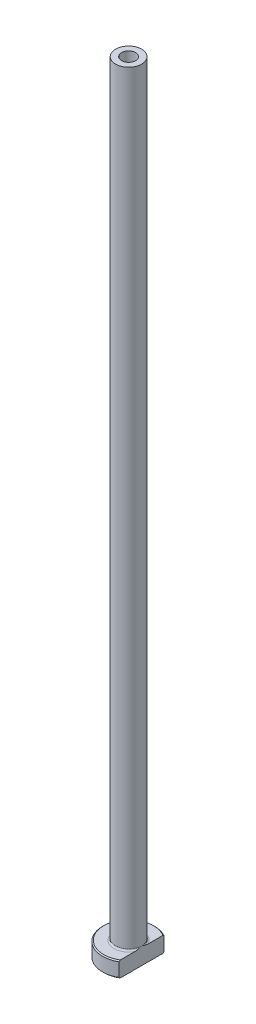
ISO-10303-21;
HEADER;
FILE_DESCRIPTION(('STEP AP214'),'2;1');
FILE_NAME('part.step','',(''),(''),'','','');
FILE_SCHEMA(('AUTOMOTIVE_DESIGN { 1 0 10303 214 1 1 1 1 }'));
ENDSEC;
DATA;
#1=APPLICATION_CONTEXT('core data for automotive mechanical design processes');
#2=APPLICATION_PROTOCOL_DEFINITION('international standard','automotive_design',2000,#1);
#3=PRODUCT_CONTEXT('',#1,'mechanical');
#4=PRODUCT('Part','Part','',(#3));
#5=PRODUCT_RELATED_PRODUCT_CATEGORY('part','',(#4));
#6=PRODUCT_DEFINITION_FORMATION('','',#4);
#7=PRODUCT_DEFINITION_CONTEXT('part definition',#1,'design');
#8=PRODUCT_DEFINITION('design','',#6,#7);
#9=PRODUCT_DEFINITION_SHAPE('','',#8);
#10=(LENGTH_UNIT() NAMED_UNIT(*) SI_UNIT(.MILLI.,.METRE.));
#11=(NAMED_UNIT(*) PLANE_ANGLE_UNIT() SI_UNIT($,.RADIAN.));
#12=(NAMED_UNIT(*) SI_UNIT($,.STERADIAN.) SOLID_ANGLE_UNIT());
#13=UNCERTAINTY_MEASURE_WITH_UNIT(LENGTH_MEASURE(1.E-05),#10,'distance_accuracy_value','');
#14=(GEOMETRIC_REPRESENTATION_CONTEXT(3) GLOBAL_UNCERTAINTY_ASSIGNED_CONTEXT((#13)) GLOBAL_UNIT_ASSIGNED_CONTEXT((#10,
#11,#12)) REPRESENTATION_CONTEXT('',''));
#15=CARTESIAN_POINT('',(0.,0.,0.));
#16=DIRECTION('',(0.,0.,1.));
#17=DIRECTION('',(1.,0.,0.));
#18=AXIS2_PLACEMENT_3D('',#15,#16,#17);
#19=CARTESIAN_POINT('',(0.,92.1876809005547,0.));
#20=DIRECTION('',(0.,1.,0.));
#21=DIRECTION('',(0.,0.,1.));
#22=AXIS2_PLACEMENT_3D('',#19,#20,#21);
#23=CYLINDRICAL_SURFACE('',#22,1.35);
#24=CARTESIAN_POINT('',(0.,150.,0.));
#25=DIRECTION('',(0.,1.,0.));
#26=DIRECTION('',(0.,0.,1.));
#27=AXIS2_PLACEMENT_3D('',#24,#25,#26);
#28=CIRCLE('',#27,1.35);
#29=CARTESIAN_POINT('',(0.,150.,1.35));
#30=VERTEX_POINT('',#29);
#31=EDGE_CURVE('E167',#30,#30,#28,.T.);
#32=ORIENTED_EDGE('',*,*,#31,.T.);
#33=EDGE_LOOP('',(#32));
#34=FACE_BOUND('',#33,.T.);
#35=CARTESIAN_POINT('',(0.,105.,0.));
#36=DIRECTION('',(0.,1.,0.));
#37=DIRECTION('',(0.,0.,1.));
#38=AXIS2_PLACEMENT_3D('',#35,#36,#37);
#39=CIRCLE('',#38,1.35);
#40=CARTESIAN_POINT('',(0.,105.,1.35));
#41=VERTEX_POINT('',#40);
#42=EDGE_CURVE('E170',#41,#41,#39,.T.);
#43=ORIENTED_EDGE('',*,*,#42,.F.);
#44=EDGE_LOOP('',(#43));
#45=FACE_BOUND('',#44,.T.);
#46=ADVANCED_FACE('F32',(#34,#45),#23,.F.);
#47=CARTESIAN_POINT('',(-1.35,150.,0.));
#48=DIRECTION('',(0.,1.,0.));
#49=DIRECTION('',(0.,0.,1.));
#50=AXIS2_PLACEMENT_3D('',#47,#48,#49);
#51=PLANE('',#50);
#52=CARTESIAN_POINT('',(0.,150.,0.));
#53=DIRECTION('',(0.,1.,0.));
#54=DIRECTION('',(0.,0.,1.));
#55=AXIS2_PLACEMENT_3D('',#52,#53,#54);
#56=CIRCLE('',#55,2.50000000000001);
#57=CARTESIAN_POINT('',(0.,150.,2.50000000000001));
#58=VERTEX_POINT('',#57);
#59=EDGE_CURVE('E174',#58,#58,#56,.T.);
#60=ORIENTED_EDGE('',*,*,#59,.T.);
#61=EDGE_LOOP('',(#60));
#62=FACE_BOUND('',#61,.T.);
#63=ORIENTED_EDGE('',*,*,#31,.F.);
#64=EDGE_LOOP('',(#63));
#65=FACE_BOUND('',#64,.T.);
#66=ADVANCED_FACE('F157',(#62,#65),#51,.T.);
#67=CARTESIAN_POINT('',(0.,92.1876809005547,0.));
#68=DIRECTION('',(0.,1.,0.));
#69=DIRECTION('',(0.,0.,1.));
#70=AXIS2_PLACEMENT_3D('',#67,#68,#69);
#71=CYLINDRICAL_SURFACE('',#70,2.5);
#72=CARTESIAN_POINT('',(0.,3.3,0.));
#73=DIRECTION('',(0.,1.,0.));
#74=DIRECTION('',(0.,0.,1.));
#75=AXIS2_PLACEMENT_3D('',#72,#73,#74);
#76=CIRCLE('',#75,2.5);
#77=CARTESIAN_POINT('',(2.5,3.3,0.));
#78=VERTEX_POINT('',#77);
#79=EDGE_CURVE('E180',#78,#78,#76,.T.);
#80=ORIENTED_EDGE('',*,*,#79,.T.);
#81=EDGE_LOOP('',(#80));
#82=FACE_BOUND('',#81,.T.);
#83=ORIENTED_EDGE('',*,*,#59,.F.);
#84=EDGE_LOOP('',(#83));
#85=FACE_BOUND('',#84,.T.);
#86=ADVANCED_FACE('F162',(#82,#85),#71,.T.);
#87=CARTESIAN_POINT('',(-2.49999999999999,3.,0.));
#88=DIRECTION('',(0.,1.,0.));
#89=DIRECTION('',(0.,0.,1.));
#90=AXIS2_PLACEMENT_3D('',#87,#88,#89);
#91=PLANE('',#90);
#92=DIRECTION('',(0.,0.,1.));
#93=VECTOR('',#92,1.);
#94=CARTESIAN_POINT('',(2.49999999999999,3.,0.));
#95=LINE('',#94,#93);
#96=CARTESIAN_POINT('',(2.5,3.,-4.09756024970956));
#97=VERTEX_POINT('',#96);
#98=CARTESIAN_POINT('',(2.49999999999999,3.,-1.26095202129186));
#99=VERTEX_POINT('',#98);
#100=EDGE_CURVE('E54',#97,#99,#95,.T.);
#101=ORIENTED_EDGE('',*,*,#100,.F.);
#102=CARTESIAN_POINT('',(0.,3.,0.));
#103=DIRECTION('',(0.,1.,0.));
#104=DIRECTION('',(0.,0.,1.));
#105=AXIS2_PLACEMENT_3D('',#102,#103,#104);
#106=CIRCLE('',#105,4.79999999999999);
#107=CARTESIAN_POINT('',(2.49999999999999,3.,4.09756024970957));
#108=VERTEX_POINT('',#107);
#109=EDGE_CURVE('E186',#97,#108,#106,.T.);
#110=ORIENTED_EDGE('',*,*,#109,.T.);
#111=CARTESIAN_POINT('',(2.49999999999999,3.,1.26095202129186));
#112=VERTEX_POINT('',#111);
#113=EDGE_CURVE('E134',#112,#108,#95,.T.);
#114=ORIENTED_EDGE('',*,*,#113,.F.);
#115=CARTESIAN_POINT('',(0.,3.,0.));
#116=DIRECTION('',(0.,1.,0.));
#117=DIRECTION('',(0.,0.,1.));
#118=AXIS2_PLACEMENT_3D('',#115,#116,#117);
#119=CIRCLE('',#118,2.8);
#120=EDGE_CURVE('E183',#112,#99,#119,.F.);
#121=ORIENTED_EDGE('',*,*,#120,.T.);
#122=EDGE_LOOP('',(#101,#110,#114,#121));
#123=FACE_BOUND('',#122,.T.);
#124=ADVANCED_FACE('F197',(#123),#91,.T.);
#125=CARTESIAN_POINT('',(0.,92.1876809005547,0.));
#126=DIRECTION('',(0.,1.,0.));
#127=DIRECTION('',(0.,0.,1.));
#128=AXIS2_PLACEMENT_3D('',#125,#126,#127);
#129=CYLINDRICAL_SURFACE('',#128,4.99999999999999);
#130=DIRECTION('',(0.,-1.,0.));
#131=VECTOR('',#130,1.);
#132=CARTESIAN_POINT('',(2.49999999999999,150.,4.33012701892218));
#133=LINE('',#132,#131);
#134=CARTESIAN_POINT('',(2.49999999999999,2.8,4.33012701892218));
#135=VERTEX_POINT('',#134);
#136=CARTESIAN_POINT('',(2.49999999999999,0.199999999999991,4.33012701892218));
#137=VERTEX_POINT('',#136);
#138=EDGE_CURVE('E82',#135,#137,#133,.T.);
#139=ORIENTED_EDGE('',*,*,#138,.F.);
#140=CARTESIAN_POINT('',(0.,2.8,0.));
#141=DIRECTION('',(0.,1.,0.));
#142=DIRECTION('',(0.,0.,1.));
#143=AXIS2_PLACEMENT_3D('',#140,#141,#142);
#144=CIRCLE('',#143,4.99999999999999);
#145=CARTESIAN_POINT('',(2.5,2.8,-4.33012701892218));
#146=VERTEX_POINT('',#145);
#147=EDGE_CURVE('E95',#135,#146,#144,.F.);
#148=ORIENTED_EDGE('',*,*,#147,.T.);
#149=DIRECTION('',(0.,-1.,0.));
#150=VECTOR('',#149,1.);
#151=CARTESIAN_POINT('',(2.5,150.,-4.33012701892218));
#152=LINE('',#151,#150);
#153=CARTESIAN_POINT('',(2.5,0.199999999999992,-4.33012701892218));
#154=VERTEX_POINT('',#153);
#155=EDGE_CURVE('E192',#146,#154,#152,.T.);
#156=ORIENTED_EDGE('',*,*,#155,.T.);
#157=CARTESIAN_POINT('',(0.,0.199999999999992,0.));
#158=DIRECTION('',(0.,-1.,0.));
#159=DIRECTION('',(0.,0.,-1.));
#160=AXIS2_PLACEMENT_3D('',#157,#158,#159);
#161=CIRCLE('',#160,4.99999999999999);
#162=EDGE_CURVE('E98',#154,#137,#161,.F.);
#163=ORIENTED_EDGE('',*,*,#162,.T.);
#164=EDGE_LOOP('',(#139,#148,#156,#163));
#165=FACE_BOUND('',#164,.T.);
#166=ADVANCED_FACE('F190',(#165),#129,.T.);
#167=CARTESIAN_POINT('',(-4.99999999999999,0.,0.));
#168=DIRECTION('',(0.,-1.,0.));
#169=DIRECTION('',(0.,0.,-1.));
#170=AXIS2_PLACEMENT_3D('',#167,#168,#169);
#171=PLANE('',#170);
#172=CARTESIAN_POINT('',(0.,0.,0.));
#173=DIRECTION('',(0.,-1.,0.));
#174=DIRECTION('',(0.,0.,-1.));
#175=AXIS2_PLACEMENT_3D('',#172,#173,#174);
#176=CIRCLE('',#175,2.09999999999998);
#177=CARTESIAN_POINT('',(0.,0.,-2.09999999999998));
#178=VERTEX_POINT('',#177);
#179=EDGE_CURVE('E40',#178,#178,#176,.F.);
#180=ORIENTED_EDGE('',*,*,#179,.T.);
#181=EDGE_LOOP('',(#180));
#182=FACE_BOUND('',#181,.T.);
#183=DIRECTION('',(0.,0.,-1.));
#184=VECTOR('',#183,1.);
#185=CARTESIAN_POINT('',(2.49999999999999,0.,4.33012701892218));
#186=LINE('',#185,#184);
#187=CARTESIAN_POINT('',(2.49999999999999,0.,4.09756024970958));
#188=VERTEX_POINT('',#187);
#189=CARTESIAN_POINT('',(2.5,0.,-4.09756024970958));
#190=VERTEX_POINT('',#189);
#191=EDGE_CURVE('E47',#188,#190,#186,.T.);
#192=ORIENTED_EDGE('',*,*,#191,.F.);
#193=CARTESIAN_POINT('',(0.,0.,0.));
#194=DIRECTION('',(0.,-1.,0.));
#195=DIRECTION('',(0.,0.,-1.));
#196=AXIS2_PLACEMENT_3D('',#193,#194,#195);
#197=CIRCLE('',#196,4.8);
#198=EDGE_CURVE('E92',#188,#190,#197,.T.);
#199=ORIENTED_EDGE('',*,*,#198,.T.);
#200=EDGE_LOOP('',(#192,#199));
#201=FACE_BOUND('',#200,.T.);
#202=ADVANCED_FACE('F91',(#182,#201),#171,.T.);
#203=CARTESIAN_POINT('',(0.,92.1876809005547,0.));
#204=DIRECTION('',(0.,1.,0.));
#205=DIRECTION('',(0.,0.,1.));
#206=AXIS2_PLACEMENT_3D('',#203,#204,#205);
#207=CYLINDRICAL_SURFACE('',#206,1.6);
#208=CARTESIAN_POINT('',(0.,0.499999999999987,0.));
#209=DIRECTION('',(0.,-1.,0.));
#210=DIRECTION('',(0.,0.,-1.));
#211=AXIS2_PLACEMENT_3D('',#208,#209,#210);
#212=CIRCLE('',#211,1.6);
#213=CARTESIAN_POINT('',(0.,0.499999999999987,-1.6));
#214=VERTEX_POINT('',#213);
#215=EDGE_CURVE('E11',#214,#214,#212,.T.);
#216=ORIENTED_EDGE('',*,*,#215,.T.);
#217=EDGE_LOOP('',(#216));
#218=FACE_BOUND('',#217,.T.);
#219=CARTESIAN_POINT('',(0.,93.,0.));
#220=DIRECTION('',(0.,1.,0.));
#221=DIRECTION('',(0.,0.,1.));
#222=AXIS2_PLACEMENT_3D('',#219,#220,#221);
#223=CIRCLE('',#222,1.6);
#224=CARTESIAN_POINT('',(0.,93.,1.6));
#225=VERTEX_POINT('',#224);
#226=EDGE_CURVE('E172',#225,#225,#223,.T.);
#227=ORIENTED_EDGE('',*,*,#226,.T.);
#228=EDGE_LOOP('',(#227));
#229=FACE_BOUND('',#228,.T.);
#230=ADVANCED_FACE('F215',(#218,#229),#207,.F.);
#231=CARTESIAN_POINT('',(0.,93.,0.));
#232=DIRECTION('',(0.,-1.,0.));
#233=DIRECTION('',(0.,0.,-1.));
#234=AXIS2_PLACEMENT_3D('',#231,#232,#233);
#235=CONICAL_SURFACE('',#234,1.6,0.0208303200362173);
#236=ORIENTED_EDGE('',*,*,#42,.T.);
#237=EDGE_LOOP('',(#236));
#238=FACE_BOUND('',#237,.T.);
#239=ORIENTED_EDGE('',*,*,#226,.F.);
#240=EDGE_LOOP('',(#239));
#241=FACE_BOUND('',#240,.T.);
#242=ADVANCED_FACE('F111',(#238,#241),#235,.F.);
#243=CARTESIAN_POINT('',(0.,3.3,0.));
#244=DIRECTION('',(0.,1.,0.));
#245=DIRECTION('',(0.,0.,1.));
#246=AXIS2_PLACEMENT_3D('',#243,#244,#245);
#247=TOROIDAL_SURFACE('',#246,2.8,0.3);
#248=ORIENTED_EDGE('',*,*,#120,.F.);
#249=CARTESIAN_POINT('',(2.5,3.3,0.));
#250=CARTESIAN_POINT('',(2.5,3.30000062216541,-4.84268862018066E-11));
#251=CARTESIAN_POINT('',(2.5,3.30000124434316,1.59621000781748E-07));
#252=CARTESIAN_POINT('',(2.5,3.30000243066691,6.45477837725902E-07));
#253=CARTESIAN_POINT('',(2.5,3.30000299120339,9.78480543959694E-07));
#254=CARTESIAN_POINT('',(2.5,3.30000411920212,1.77471958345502E-06));
#255=CARTESIAN_POINT('',(2.5,3.30000467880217,2.24902118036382E-06));
#256=CARTESIAN_POINT('',(2.5,3.30000572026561,3.2595365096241E-06));
#257=CARTESIAN_POINT('',(2.5,3.30000620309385,3.79480713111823E-06));
#258=CARTESIAN_POINT('',(2.5,3.30000787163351,5.75794592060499E-06));
#259=CARTESIAN_POINT('',(2.5,3.30000896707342,7.26424074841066E-06));
#260=CARTESIAN_POINT('',(2.5,3.3000108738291,1.03361126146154E-05));
#261=CARTESIAN_POINT('',(2.5,3.30001169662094,1.18949496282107E-05));
#262=CARTESIAN_POINT('',(2.5,3.30001489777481,1.81400847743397E-05));
#263=CARTESIAN_POINT('',(2.5,3.30001712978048,2.29062173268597E-05));
#264=CARTESIAN_POINT('',(2.5,3.30002067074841,3.21793861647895E-05));
#265=CARTESIAN_POINT('',(2.5,3.30002205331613,3.66588983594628E-05));
#266=CARTESIAN_POINT('',(2.5,3.30002810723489,5.6171839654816E-05));
#267=CARTESIAN_POINT('',(2.5,3.30003284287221,7.11735855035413E-05));
#268=CARTESIAN_POINT('',(2.5,3.30004025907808,9.8992031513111E-05));
#269=CARTESIAN_POINT('',(2.5,3.30004315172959,0.000111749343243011));
#270=CARTESIAN_POINT('',(2.5,3.30006652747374,0.000206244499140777));
#271=CARTESIAN_POINT('',(2.5,3.30009698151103,0.00028511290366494));
#272=CARTESIAN_POINT('',(2.49999999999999,3.30021213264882,0.000594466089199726));
#273=CARTESIAN_POINT('',(2.5,3.30028938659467,0.000826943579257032));
#274=CARTESIAN_POINT('',(2.5,3.30059681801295,0.00173885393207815));
#275=CARTESIAN_POINT('',(2.5,3.30083479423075,0.00241625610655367));
#276=CARTESIAN_POINT('',(2.49999999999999,3.30181198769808,0.00521069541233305));
#277=CARTESIAN_POINT('',(2.49999999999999,3.30254240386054,0.00732996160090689));
#278=CARTESIAN_POINT('',(2.5,3.31226043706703,0.0355096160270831));
#279=CARTESIAN_POINT('',(2.5,3.32130808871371,0.0615551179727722));
#280=CARTESIAN_POINT('',(2.49999999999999,3.33896212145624,0.112677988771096));
#281=CARTESIAN_POINT('',(2.49999999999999,3.34757212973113,0.137754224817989));
#282=CARTESIAN_POINT('',(2.5,3.36573068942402,0.190981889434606));
#283=CARTESIAN_POINT('',(2.5,3.3752665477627,0.219137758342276));
#284=CARTESIAN_POINT('',(2.5,3.3942286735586,0.27581610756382));
#285=CARTESIAN_POINT('',(2.5,3.40365272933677,0.304339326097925));
#286=CARTESIAN_POINT('',(2.5,3.426416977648,0.374416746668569));
#287=CARTESIAN_POINT('',(2.5,3.43959811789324,0.416023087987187));
#288=CARTESIAN_POINT('',(2.5,3.46479157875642,0.498481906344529));
#289=CARTESIAN_POINT('',(2.5,3.47682455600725,0.539328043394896));
#290=CARTESIAN_POINT('',(2.5,3.5022442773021,0.629981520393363));
#291=CARTESIAN_POINT('',(2.5,3.51538048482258,0.679860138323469));
#292=CARTESIAN_POINT('',(2.5,3.53964074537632,0.780511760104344));
#293=CARTESIAN_POINT('',(2.5,3.55074877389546,0.831288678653));
#294=CARTESIAN_POINT('',(2.5,3.57087054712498,0.937063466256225));
#295=CARTESIAN_POINT('',(2.5,3.57967623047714,0.9921022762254));
#296=CARTESIAN_POINT('',(2.5,3.59301148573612,1.1025602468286));
#297=CARTESIAN_POINT('',(2.5,3.59755297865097,1.1579779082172));
#298=CARTESIAN_POINT('',(2.5,3.60093314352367,1.26786705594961));
#299=CARTESIAN_POINT('',(2.5,3.5998936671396,1.32233291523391));
#300=CARTESIAN_POINT('',(2.5,3.59277279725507,1.40310062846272));
#301=CARTESIAN_POINT('',(2.5,3.5895213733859,1.42965222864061));
#302=CARTESIAN_POINT('',(2.5,3.58085857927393,1.48239078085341));
#303=CARTESIAN_POINT('',(2.5,3.57544928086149,1.50857805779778));
#304=CARTESIAN_POINT('',(2.5,3.56298810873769,1.55658799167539));
#305=CARTESIAN_POINT('',(2.5,3.55628200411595,1.57849902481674));
#306=CARTESIAN_POINT('',(2.5,3.54055393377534,1.621602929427));
#307=CARTESIAN_POINT('',(2.5,3.53152220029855,1.6427923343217));
#308=CARTESIAN_POINT('',(2.5,3.5105719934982,1.68404469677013));
#309=CARTESIAN_POINT('',(2.5,3.49862012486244,1.70409105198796));
#310=CARTESIAN_POINT('',(2.5,3.47134074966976,1.74172093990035));
#311=CARTESIAN_POINT('',(2.5,3.45603127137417,1.75931683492));
#312=CARTESIAN_POINT('',(2.5,3.42979930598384,1.78297070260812));
#313=CARTESIAN_POINT('',(2.5,3.42024268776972,1.7905414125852));
#314=CARTESIAN_POINT('',(2.5,3.40009035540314,1.80416997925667));
#315=CARTESIAN_POINT('',(2.5,3.38949499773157,1.81022835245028));
#316=CARTESIAN_POINT('',(2.5,3.36727740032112,1.82047087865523));
#317=CARTESIAN_POINT('',(2.5,3.35564531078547,1.82463409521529));
#318=CARTESIAN_POINT('',(2.5,3.33178837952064,1.83058442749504));
#319=CARTESIAN_POINT('',(2.5,3.31956435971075,1.83237474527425));
#320=CARTESIAN_POINT('',(2.5,3.29665736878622,1.83331852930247));
#321=CARTESIAN_POINT('',(2.5,3.28598670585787,1.83279233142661));
#322=CARTESIAN_POINT('',(2.5,3.2649074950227,1.82986307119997));
#323=CARTESIAN_POINT('',(2.5,3.25449899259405,1.82745968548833));
#324=CARTESIAN_POINT('',(2.5,3.23467098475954,1.82111257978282));
#325=CARTESIAN_POINT('',(2.5,3.22522816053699,1.81724026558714));
#326=CARTESIAN_POINT('',(2.5,3.20699535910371,1.8081949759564));
#327=CARTESIAN_POINT('',(2.5,3.1982055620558,1.80302164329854));
#328=CARTESIAN_POINT('',(2.5,3.17663162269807,1.78842115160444));
#329=CARTESIAN_POINT('',(2.5,3.1643622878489,1.77823293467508));
#330=CARTESIAN_POINT('',(2.5,3.14157828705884,1.75604629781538));
#331=CARTESIAN_POINT('',(2.5,3.13106906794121,1.74404246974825));
#332=CARTESIAN_POINT('',(2.5,3.1060052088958,1.71142114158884));
#333=CARTESIAN_POINT('',(2.5,3.09267476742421,1.689868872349));
#334=CARTESIAN_POINT('',(2.5,3.06940323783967,1.64508572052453));
#335=CARTESIAN_POINT('',(2.5,3.05946314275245,1.62185434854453));
#336=CARTESIAN_POINT('',(2.5,3.035457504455,1.55546754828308));
#337=CARTESIAN_POINT('',(2.5,3.02444022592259,1.51122187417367));
#338=CARTESIAN_POINT('',(2.5,3.00863926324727,1.42119777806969));
#339=CARTESIAN_POINT('',(2.5,3.00393876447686,1.37540689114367));
#340=CARTESIAN_POINT('',(2.5,2.99924212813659,1.28072198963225));
#341=CARTESIAN_POINT('',(2.5,2.99956098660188,1.23181420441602));
#342=CARTESIAN_POINT('',(2.5,3.00436098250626,1.13410944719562));
#343=CARTESIAN_POINT('',(2.5,3.00885327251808,1.08531312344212));
#344=CARTESIAN_POINT('',(2.5,3.0207419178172,0.990773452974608));
#345=CARTESIAN_POINT('',(2.5,3.02796792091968,0.945007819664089));
#346=CARTESIAN_POINT('',(2.5,3.04465555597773,0.854199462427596));
#347=CARTESIAN_POINT('',(2.5,3.05410250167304,0.809153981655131));
#348=CARTESIAN_POINT('',(2.5,3.07710029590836,0.709411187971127));
#349=CARTESIAN_POINT('',(2.5,3.09109633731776,0.654817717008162));
#350=CARTESIAN_POINT('',(2.5,3.12140740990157,0.544863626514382));
#351=CARTESIAN_POINT('',(2.5,3.13777040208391,0.489516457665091));
#352=CARTESIAN_POINT('',(2.5,3.16649540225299,0.396740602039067));
#353=CARTESIAN_POINT('',(2.5,3.17848130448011,0.359193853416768));
#354=CARTESIAN_POINT('',(2.5,3.20280507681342,0.284651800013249));
#355=CARTESIAN_POINT('',(2.5,3.21513791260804,0.247654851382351));
#356=CARTESIAN_POINT('',(2.49999999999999,3.23873713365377,0.177767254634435));
#357=CARTESIAN_POINT('',(2.49999999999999,3.24997409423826,0.144866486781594));
#358=CARTESIAN_POINT('',(2.5,3.27307149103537,0.0777985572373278));
#359=CARTESIAN_POINT('',(2.5,3.28493883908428,0.043633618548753));
#360=CARTESIAN_POINT('',(2.49999999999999,3.29745794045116,0.0073287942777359));
#361=CARTESIAN_POINT('',(2.49999999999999,3.29818879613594,0.00520838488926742));
#362=CARTESIAN_POINT('',(2.5,3.29916610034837,0.00241367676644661));
#363=CARTESIAN_POINT('',(2.5,3.29940376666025,0.00173715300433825));
#364=CARTESIAN_POINT('',(2.5,3.29971082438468,0.000826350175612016));
#365=CARTESIAN_POINT('',(2.49999999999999,3.29978800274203,0.000594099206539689));
#366=CARTESIAN_POINT('',(2.5,3.29990305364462,0.000285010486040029));
#367=CARTESIAN_POINT('',(2.5,3.29993349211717,0.000206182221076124));
#368=CARTESIAN_POINT('',(2.5,3.29995685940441,0.000111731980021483));
#369=CARTESIAN_POINT('',(2.5,3.29995975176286,9.89774305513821E-05));
#370=CARTESIAN_POINT('',(2.5,3.2999671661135,7.11651868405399E-05));
#371=CARTESIAN_POINT('',(2.5,3.29997189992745,5.61668083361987E-05));
#372=CARTESIAN_POINT('',(2.5,3.29997795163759,3.66576319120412E-05));
#373=CARTESIAN_POINT('',(2.5,3.29997933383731,3.21785235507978E-05));
#374=CARTESIAN_POINT('',(2.5,3.29998287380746,2.29061366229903E-05));
#375=CARTESIAN_POINT('',(2.5,3.29998510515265,1.81403653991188E-05));
#376=CARTESIAN_POINT('',(2.5,3.29998830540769,1.18955817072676E-05));
#377=CARTESIAN_POINT('',(2.5,3.29998912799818,1.03367756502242E-05));
#378=CARTESIAN_POINT('',(2.5,3.29999103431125,7.26492731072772E-06));
#379=CARTESIAN_POINT('',(2.5,3.29999212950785,5.75862233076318E-06));
#380=CARTESIAN_POINT('',(2.5,3.29999379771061,3.79542429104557E-06));
#381=CARTESIAN_POINT('',(2.5,3.29999428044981,3.2601272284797E-06));
#382=CARTESIAN_POINT('',(2.5,3.29999532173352,2.24954298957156E-06));
#383=CARTESIAN_POINT('',(2.5,3.29999588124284,1.77519864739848E-06));
#384=CARTESIAN_POINT('',(2.5,3.29999700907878,9.7885688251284E-07));
#385=CARTESIAN_POINT('',(2.5,3.29999756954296,6.45796888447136E-07));
#386=CARTESIAN_POINT('',(2.5,3.29999875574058,1.59799538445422E-07));
#387=CARTESIAN_POINT('',(2.5,3.29999937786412,4.84250876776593E-11));
#388=CARTESIAN_POINT('',(2.5,3.3,0.));
#389=B_SPLINE_CURVE_WITH_KNOTS('',3,(#249,#250,#251,#252,#253,#254,#255,#256,#257,#258,#259,
#260,#261,#262,#263,#264,#265,#266,#267,#268,#269,#270,#271,#272,#273,#274,#275,#276,#277,#278,
#279,#280,#281,#282,#283,#284,#285,#286,#287,#288,#289,#290,#291,#292,#293,#294,#295,#296,#297,
#298,#299,#300,#301,#302,#303,#304,#305,#306,#307,#308,#309,#310,#311,#312,#313,#314,#315,#316,
#317,#318,#319,#320,#321,#322,#323,#324,#325,#326,#327,#328,#329,#330,#331,#332,#333,#334,#335,
#336,#337,#338,#339,#340,#341,#342,#343,#344,#345,#346,#347,#348,#349,#350,#351,#352,#353,#354,
#355,#356,#357,#358,#359,#360,#361,#362,#363,#364,#365,#366,#367,#368,#369,#370,#371,#372,#373,
#374,#375,#376,#377,#378,#379,#380,#381,#382,#383,#384,#385,#386,#387,#388),.UNSPECIFIED.,.T.,
.F.,(4,2,2,2,2,2,2,2,2,2,2,2,2,2,2,2,2,2,2,2,2,2,2,2,2,2,2,2,2,2,2,2,2,2,2,2,2,2,2,2,2,2,2,2,2,
2,2,2,2,2,2,2,2,2,2,2,2,2,2,2,2,2,2,2,2,2,2,2,2,4),(0.,1.86789273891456E-06,
3.81549688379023E-06,6.0061057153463E-06,8.1665309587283E-06,1.37285604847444E-05,
1.90122189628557E-05,3.4759730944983E-05,4.88082642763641E-05,9.59978466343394E-05,
0.000135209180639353,0.000388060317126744,0.00112364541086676,0.00327678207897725,
0.0100024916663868,0.092712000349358,0.172253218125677,0.261432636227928,0.351551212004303,
0.482477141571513,0.610212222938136,0.76491521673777,0.920792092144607,1.08787897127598,
1.25449733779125,1.41749285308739,1.49767530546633,1.57778095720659,1.64642481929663,
1.71536183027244,1.78512750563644,1.85452737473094,1.89099315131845,1.92744645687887,
1.96429324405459,2.00109025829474,2.0329710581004,2.06485735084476,2.09535926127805,
2.12586955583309,2.17344034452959,2.22115572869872,2.29675134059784,2.3723690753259,
2.50839721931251,2.64619971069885,2.79268284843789,2.93955855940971,3.07848421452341,
3.21651583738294,3.38554045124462,3.55865938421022,3.67689643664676,3.79388863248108,
3.89819085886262,4.00668323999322,4.01341261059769,4.01556295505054,4.01629782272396,
4.01655054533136,4.01658974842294,4.01663692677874,4.01665097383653,4.01666671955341,
4.01667200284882,4.01667756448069,4.01667972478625,4.01668191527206,4.01668386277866,
4.01668573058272),.UNSPECIFIED.);
#390=EDGE_CURVE('E126',#112,#78,#389,.T.);
#391=ORIENTED_EDGE('',*,*,#390,.T.);
#392=ORIENTED_EDGE('',*,*,#79,.F.);
#393=CARTESIAN_POINT('',(2.5,3.3,0.));
#394=CARTESIAN_POINT('',(2.5,3.29999937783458,4.84274325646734E-11));
#395=CARTESIAN_POINT('',(2.5,3.29999875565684,-1.59621000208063E-07));
#396=CARTESIAN_POINT('',(2.5,3.29999756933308,-6.4547783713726E-07));
#397=CARTESIAN_POINT('',(2.5,3.29999700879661,-9.78480543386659E-07));
#398=CARTESIAN_POINT('',(2.5,3.29999588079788,-1.77471958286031E-06));
#399=CARTESIAN_POINT('',(2.5,3.29999532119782,-2.24902117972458E-06));
#400=CARTESIAN_POINT('',(2.5,3.29999427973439,-3.25953650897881E-06));
#401=CARTESIAN_POINT('',(2.5,3.29999379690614,-3.79480713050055E-06));
#402=CARTESIAN_POINT('',(2.5,3.29999212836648,-5.75794592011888E-06));
#403=CARTESIAN_POINT('',(2.5,3.29999103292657,-7.26424074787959E-06));
#404=CARTESIAN_POINT('',(2.5,3.29998912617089,-1.03361126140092E-05));
#405=CARTESIAN_POINT('',(2.5,3.29998830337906,-1.18949496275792E-05));
#406=CARTESIAN_POINT('',(2.5,3.29998510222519,-1.814008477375E-05));
#407=CARTESIAN_POINT('',(2.5,3.29998287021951,-2.29062173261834E-05));
#408=CARTESIAN_POINT('',(2.5,3.29997932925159,-3.21793861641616E-05));
#409=CARTESIAN_POINT('',(2.5,3.29997794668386,-3.66588983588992E-05));
#410=CARTESIAN_POINT('',(2.5,3.29997189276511,-5.61718396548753E-05));
#411=CARTESIAN_POINT('',(2.5,3.29996715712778,-7.11735855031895E-05));
#412=CARTESIAN_POINT('',(2.5,3.29995974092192,-9.89920315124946E-05));
#413=CARTESIAN_POINT('',(2.5,3.2999568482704,-0.000111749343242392));
#414=CARTESIAN_POINT('',(2.5,3.29993347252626,-0.000206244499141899));
#415=CARTESIAN_POINT('',(2.5,3.29990301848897,-0.000285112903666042));
#416=CARTESIAN_POINT('',(2.49999999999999,3.29978786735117,-0.000594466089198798));
#417=CARTESIAN_POINT('',(2.5,3.29971061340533,-0.000826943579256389));
#418=CARTESIAN_POINT('',(2.5,3.29940318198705,-0.00173885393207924));
#419=CARTESIAN_POINT('',(2.5,3.29916520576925,-0.00241625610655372));
#420=CARTESIAN_POINT('',(2.49999999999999,3.29818801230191,-0.00521069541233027));
#421=CARTESIAN_POINT('',(2.49999999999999,3.29745759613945,-0.00732996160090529));
#422=CARTESIAN_POINT('',(2.5,3.28773956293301,-0.0355096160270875));
#423=CARTESIAN_POINT('',(2.5,3.2786919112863,-0.0615551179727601));
#424=CARTESIAN_POINT('',(2.49999999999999,3.26103787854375,-0.112677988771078));
#425=CARTESIAN_POINT('',(2.49999999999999,3.25242787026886,-0.13775422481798));
#426=CARTESIAN_POINT('',(2.5,3.23426931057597,-0.190981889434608));
#427=CARTESIAN_POINT('',(2.5,3.22473345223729,-0.21913775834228));
#428=CARTESIAN_POINT('',(2.5,3.20577132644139,-0.275816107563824));
#429=CARTESIAN_POINT('',(2.5,3.19634727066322,-0.304339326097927));
#430=CARTESIAN_POINT('',(2.5,3.173583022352,-0.374416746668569));
#431=CARTESIAN_POINT('',(2.5,3.16040188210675,-0.416023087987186));
#432=CARTESIAN_POINT('',(2.5,3.13520842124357,-0.498481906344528));
#433=CARTESIAN_POINT('',(2.5,3.12317544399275,-0.539328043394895));
#434=CARTESIAN_POINT('',(2.5,3.0977557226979,-0.629981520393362));
#435=CARTESIAN_POINT('',(2.5,3.08461951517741,-0.679860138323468));
#436=CARTESIAN_POINT('',(2.5,3.06035925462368,-0.780511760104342));
#437=CARTESIAN_POINT('',(2.5,3.04925122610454,-0.831288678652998));
#438=CARTESIAN_POINT('',(2.5,3.02912945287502,-0.937063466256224));
#439=CARTESIAN_POINT('',(2.5,3.02032376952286,-0.992102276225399));
#440=CARTESIAN_POINT('',(2.5,3.00698851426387,-1.1025602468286));
#441=CARTESIAN_POINT('',(2.5,3.00244702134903,-1.1579779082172));
#442=CARTESIAN_POINT('',(2.5,2.99906685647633,-1.26786705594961));
#443=CARTESIAN_POINT('',(2.5,3.0001063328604,-1.32233291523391));
#444=CARTESIAN_POINT('',(2.5,3.00722720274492,-1.40310062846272));
#445=CARTESIAN_POINT('',(2.5,3.01047862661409,-1.4296522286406));
#446=CARTESIAN_POINT('',(2.5,3.01914142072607,-1.48239078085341));
#447=CARTESIAN_POINT('',(2.5,3.0245507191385,-1.50857805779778));
#448=CARTESIAN_POINT('',(2.5,3.0370118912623,-1.55658799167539));
#449=CARTESIAN_POINT('',(2.5,3.04371799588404,-1.57849902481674));
#450=CARTESIAN_POINT('',(2.5,3.05944606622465,-1.621602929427));
#451=CARTESIAN_POINT('',(2.5,3.06847779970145,-1.6427923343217));
#452=CARTESIAN_POINT('',(2.5,3.08942800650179,-1.68404469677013));
#453=CARTESIAN_POINT('',(2.5,3.10137987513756,-1.70409105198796));
#454=CARTESIAN_POINT('',(2.5,3.12865925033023,-1.74172093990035));
#455=CARTESIAN_POINT('',(2.5,3.14396872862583,-1.75931683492));
#456=CARTESIAN_POINT('',(2.5,3.17020069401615,-1.78297070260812));
#457=CARTESIAN_POINT('',(2.5,3.17975731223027,-1.7905414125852));
#458=CARTESIAN_POINT('',(2.5,3.19990964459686,-1.80416997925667));
#459=CARTESIAN_POINT('',(2.5,3.21050500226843,-1.81022835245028));
#460=CARTESIAN_POINT('',(2.5,3.23272259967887,-1.82047087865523));
#461=CARTESIAN_POINT('',(2.5,3.24435468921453,-1.82463409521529));
#462=CARTESIAN_POINT('',(2.5,3.26821162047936,-1.83058442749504));
#463=CARTESIAN_POINT('',(2.5,3.28043564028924,-1.83237474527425));
#464=CARTESIAN_POINT('',(2.5,3.30334263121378,-1.83331852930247));
#465=CARTESIAN_POINT('',(2.5,3.31401329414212,-1.8327923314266));
#466=CARTESIAN_POINT('',(2.5,3.33509250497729,-1.82986307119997));
#467=CARTESIAN_POINT('',(2.5,3.34550100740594,-1.82745968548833));
#468=CARTESIAN_POINT('',(2.5,3.36532901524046,-1.82111257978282));
#469=CARTESIAN_POINT('',(2.5,3.374771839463,-1.81724026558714));
#470=CARTESIAN_POINT('',(2.5,3.39300464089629,-1.8081949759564));
#471=CARTESIAN_POINT('',(2.5,3.4017944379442,-1.80302164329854));
#472=CARTESIAN_POINT('',(2.5,3.42336837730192,-1.78842115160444));
#473=CARTESIAN_POINT('',(2.5,3.43563771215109,-1.77823293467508));
#474=CARTESIAN_POINT('',(2.5,3.45842171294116,-1.75604629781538));
#475=CARTESIAN_POINT('',(2.5,3.46893093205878,-1.74404246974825));
#476=CARTESIAN_POINT('',(2.5,3.49399479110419,-1.71142114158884));
#477=CARTESIAN_POINT('',(2.5,3.50732523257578,-1.689868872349));
#478=CARTESIAN_POINT('',(2.5,3.53059676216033,-1.64508572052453));
#479=CARTESIAN_POINT('',(2.5,3.54053685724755,-1.62185434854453));
#480=CARTESIAN_POINT('',(2.5,3.564542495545,-1.55546754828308));
#481=CARTESIAN_POINT('',(2.5,3.5755597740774,-1.51122187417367));
#482=CARTESIAN_POINT('',(2.5,3.59136073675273,-1.42119777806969));
#483=CARTESIAN_POINT('',(2.5,3.59606123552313,-1.37540689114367));
#484=CARTESIAN_POINT('',(2.5,3.6007578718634,-1.28072198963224));
#485=CARTESIAN_POINT('',(2.5,3.60043901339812,-1.23181420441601));
#486=CARTESIAN_POINT('',(2.5,3.59563901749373,-1.13410944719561));
#487=CARTESIAN_POINT('',(2.5,3.59114672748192,-1.08531312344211));
#488=CARTESIAN_POINT('',(2.5,3.5792580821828,-0.990773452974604));
#489=CARTESIAN_POINT('',(2.5,3.57203207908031,-0.945007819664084));
#490=CARTESIAN_POINT('',(2.5,3.55534444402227,-0.85419946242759));
#491=CARTESIAN_POINT('',(2.5,3.54589749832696,-0.809153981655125));
#492=CARTESIAN_POINT('',(2.5,3.52289970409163,-0.70941118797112));
#493=CARTESIAN_POINT('',(2.5,3.50890366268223,-0.654817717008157));
#494=CARTESIAN_POINT('',(2.5,3.47859259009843,-0.544863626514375));
#495=CARTESIAN_POINT('',(2.5,3.46222959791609,-0.489516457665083));
#496=CARTESIAN_POINT('',(2.5,3.433504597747,-0.396740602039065));
#497=CARTESIAN_POINT('',(2.5,3.42151869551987,-0.359193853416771));
#498=CARTESIAN_POINT('',(2.5,3.39719492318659,-0.284651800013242));
#499=CARTESIAN_POINT('',(2.5,3.38486208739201,-0.24765485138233));
#500=CARTESIAN_POINT('',(2.49999999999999,3.36126286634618,-0.177767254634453));
#501=CARTESIAN_POINT('',(2.49999999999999,3.35002590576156,-0.144866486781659));
#502=CARTESIAN_POINT('',(2.5,3.32692850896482,-0.0777985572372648));
#503=CARTESIAN_POINT('',(2.5,3.31506116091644,-0.043633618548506));
#504=CARTESIAN_POINT('',(2.49999999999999,3.30254205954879,-0.00732879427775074));
#505=CARTESIAN_POINT('',(2.49999999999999,3.30181120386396,-0.00520838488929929));
#506=CARTESIAN_POINT('',(2.5,3.30083389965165,-0.00241367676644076));
#507=CARTESIAN_POINT('',(2.5,3.30059623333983,-0.00173715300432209));
#508=CARTESIAN_POINT('',(2.5,3.30028917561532,-0.000826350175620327));
#509=CARTESIAN_POINT('',(2.49999999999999,3.30021199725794,-0.000594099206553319));
#510=CARTESIAN_POINT('',(2.5,3.30009694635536,-0.000285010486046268));
#511=CARTESIAN_POINT('',(2.5,3.30006650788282,-0.000206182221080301));
#512=CARTESIAN_POINT('',(2.5,3.30004314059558,-0.000111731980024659));
#513=CARTESIAN_POINT('',(2.5,3.30004024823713,-9.89774305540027E-05));
#514=CARTESIAN_POINT('',(2.5,3.30003283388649,-7.11651868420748E-05));
#515=CARTESIAN_POINT('',(2.5,3.30002810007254,-5.61668083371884E-05));
#516=CARTESIAN_POINT('',(2.5,3.3000220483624,-3.66576319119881E-05));
#517=CARTESIAN_POINT('',(2.5,3.30002066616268,-3.21785235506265E-05));
#518=CARTESIAN_POINT('',(2.5,3.30001712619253,-2.29061366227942E-05));
#519=CARTESIAN_POINT('',(2.5,3.30001489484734,-1.81403653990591E-05));
#520=CARTESIAN_POINT('',(2.5,3.3000116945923,-1.18955817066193E-05));
#521=CARTESIAN_POINT('',(2.5,3.30001087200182,-1.03367756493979E-05));
#522=CARTESIAN_POINT('',(2.5,3.30000896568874,-7.26492730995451E-06));
#523=CARTESIAN_POINT('',(2.5,3.30000787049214,-5.75862233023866E-06));
#524=CARTESIAN_POINT('',(2.5,3.30000620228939,-3.79542429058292E-06));
#525=CARTESIAN_POINT('',(2.5,3.30000571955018,-3.26012722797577E-06));
#526=CARTESIAN_POINT('',(2.5,3.30000467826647,-2.24954298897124E-06));
#527=CARTESIAN_POINT('',(2.5,3.30000411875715,-1.77519864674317E-06));
#528=CARTESIAN_POINT('',(2.5,3.30000299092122,-9.78856881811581E-07));
#529=CARTESIAN_POINT('',(2.5,3.30000243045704,-6.45796887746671E-07));
#530=CARTESIAN_POINT('',(2.5,3.30000124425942,-1.59799537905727E-07));
#531=CARTESIAN_POINT('',(2.5,3.30000062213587,-4.84246324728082E-11));
#532=CARTESIAN_POINT('',(2.5,3.3,0.));
#533=B_SPLINE_CURVE_WITH_KNOTS('',3,(#393,#394,#395,#396,#397,#398,#399,#400,#401,#402,#403,
#404,#405,#406,#407,#408,#409,#410,#411,#412,#413,#414,#415,#416,#417,#418,#419,#420,#421,#422,
#423,#424,#425,#426,#427,#428,#429,#430,#431,#432,#433,#434,#435,#436,#437,#438,#439,#440,#441,
#442,#443,#444,#445,#446,#447,#448,#449,#450,#451,#452,#453,#454,#455,#456,#457,#458,#459,#460,
#461,#462,#463,#464,#465,#466,#467,#468,#469,#470,#471,#472,#473,#474,#475,#476,#477,#478,#479,
#480,#481,#482,#483,#484,#485,#486,#487,#488,#489,#490,#491,#492,#493,#494,#495,#496,#497,#498,
#499,#500,#501,#502,#503,#504,#505,#506,#507,#508,#509,#510,#511,#512,#513,#514,#515,#516,#517,
#518,#519,#520,#521,#522,#523,#524,#525,#526,#527,#528,#529,#530,#531,#532),.UNSPECIFIED.,.T.,
.F.,(4,2,2,2,2,2,2,2,2,2,2,2,2,2,2,2,2,2,2,2,2,2,2,2,2,2,2,2,2,2,2,2,2,2,2,2,2,2,2,2,2,2,2,2,2,
2,2,2,2,2,2,2,2,2,2,2,2,2,2,2,2,2,2,2,2,2,2,2,2,4),(0.,1.86789273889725E-06,
3.81549688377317E-06,6.00610571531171E-06,8.16653095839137E-06,1.37285604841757E-05,
1.9012218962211E-05,3.47597309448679E-05,4.88082642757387E-05,9.59978466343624E-05,
0.00013520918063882,0.000388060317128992,0.00112364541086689,0.00327678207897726,
0.0100024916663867,0.0927120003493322,0.172253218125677,0.261432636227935,0.351551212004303,
0.482477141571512,0.610212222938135,0.764915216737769,0.920792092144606,1.08787897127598,
1.25449733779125,1.41749285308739,1.49767530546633,1.57778095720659,1.64642481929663,
1.71536183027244,1.78512750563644,1.85452737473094,1.89099315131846,1.92744645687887,
1.9642932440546,2.00109025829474,2.0329710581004,2.06485735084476,2.09535926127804,
2.12586955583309,2.17344034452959,2.22115572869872,2.29675134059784,2.3723690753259,
2.5083972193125,2.64619971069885,2.79268284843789,2.93955855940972,3.07848421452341,
3.21651583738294,3.38554045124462,3.55865938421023,3.67689643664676,3.79388863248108,
3.89819085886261,4.00668323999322,4.01341261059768,4.01556295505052,4.01629782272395,
4.01655054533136,4.01658974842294,4.01663692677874,4.01665097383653,4.01666671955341,
4.01667200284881,4.01667756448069,4.01667972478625,4.01668191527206,4.01668386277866,
4.01668573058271),.UNSPECIFIED.);
#534=EDGE_CURVE('E135',#78,#99,#533,.T.);
#535=ORIENTED_EDGE('',*,*,#534,.T.);
#536=EDGE_LOOP('',(#248,#391,#392,#535));
#537=FACE_BOUND('',#536,.T.);
#538=ADVANCED_FACE('F141',(#537),#247,.F.);
#539=CARTESIAN_POINT('',(0.,3.,0.));
#540=DIRECTION('',(0.,-1.,0.));
#541=DIRECTION('',(0.,0.,-1.));
#542=AXIS2_PLACEMENT_3D('',#539,#540,#541);
#543=CONICAL_SURFACE('',#542,4.79999999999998,0.785398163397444);
#544=CARTESIAN_POINT('',(2.5,-2.05039133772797,-9.52786489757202));
#545=CARTESIAN_POINT('',(2.5,-1.84160367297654,-9.31199733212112));
#546=CARTESIAN_POINT('',(2.5,-1.6330400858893,-9.09591231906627));
#547=CARTESIAN_POINT('',(2.5,-1.21649358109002,-8.66317810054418));
#548=CARTESIAN_POINT('',(2.5,-1.00851067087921,-8.4465288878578));
#549=CARTESIAN_POINT('',(2.5,-0.59315724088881,-8.01243155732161));
#550=CARTESIAN_POINT('',(2.5,-0.385787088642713,-7.79498308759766));
#551=CARTESIAN_POINT('',(2.5,0.028036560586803,-7.35921771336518));
#552=CARTESIAN_POINT('',(2.5,0.234490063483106,-7.14090081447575));
#553=CARTESIAN_POINT('',(2.5,0.642130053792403,-6.70748960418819));
#554=CARTESIAN_POINT('',(2.5,0.843339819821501,-6.49241720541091));
#555=CARTESIAN_POINT('',(2.5,1.24425381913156,-6.06087422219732));
#556=CARTESIAN_POINT('',(2.5,1.44395806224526,-5.84440364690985));
#557=CARTESIAN_POINT('',(2.5,1.8412775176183,-5.40963663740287));
#558=CARTESIAN_POINT('',(2.5,2.03889317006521,-5.191340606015));
#559=CARTESIAN_POINT('',(2.5,2.4312504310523,-4.75218509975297));
#560=CARTESIAN_POINT('',(2.5,2.62599215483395,-4.53132572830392));
#561=CARTESIAN_POINT('',(2.5,2.9369378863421,-4.17181619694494));
#562=CARTESIAN_POINT('',(2.5,3.05446493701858,-4.03431188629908));
#563=CARTESIAN_POINT('',(2.5,3.28742704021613,-3.75751486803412));
#564=CARTESIAN_POINT('',(2.5,3.40286188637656,-3.61822198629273));
#565=CARTESIAN_POINT('',(2.5,3.63213234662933,-3.33586492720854));
#566=CARTESIAN_POINT('',(2.5,3.74593818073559,-3.19277645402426));
#567=CARTESIAN_POINT('',(2.5,3.96956266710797,-2.90356071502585));
#568=CARTESIAN_POINT('',(2.5,4.07938227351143,-2.75743418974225));
#569=CARTESIAN_POINT('',(2.5,4.29502410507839,-2.45881038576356));
#570=CARTESIAN_POINT('',(2.5,4.40076032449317,-2.30625006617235));
#571=CARTESIAN_POINT('',(2.5,4.55286945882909,-2.07299325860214));
#572=CARTESIAN_POINT('',(2.5,4.60252613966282,-1.99444197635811));
#573=CARTESIAN_POINT('',(2.5,4.69908164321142,-1.83566827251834));
#574=CARTESIAN_POINT('',(2.5,4.74598077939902,-1.75544604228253));
#575=CARTESIAN_POINT('',(2.5,4.83578466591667,-1.59405362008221));
#576=CARTESIAN_POINT('',(2.5,4.87873126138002,-1.51290702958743));
#577=CARTESIAN_POINT('',(2.5,4.96038600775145,-1.34852090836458));
#578=CARTESIAN_POINT('',(2.5,4.99909338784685,-1.26528100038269));
#579=CARTESIAN_POINT('',(2.5,5.10703093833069,-1.0125177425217));
#580=CARTESIAN_POINT('',(2.5,5.16843307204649,-0.839342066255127));
#581=CARTESIAN_POINT('',(2.5,5.23490554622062,-0.579703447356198));
#582=CARTESIAN_POINT('',(2.5,5.25253806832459,-0.496421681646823));
#583=CARTESIAN_POINT('',(2.5,5.27986337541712,-0.32853597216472));
#584=CARTESIAN_POINT('',(2.5,5.28955686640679,-0.243932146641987));
#585=CARTESIAN_POINT('',(2.5,5.30031768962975,-0.0744340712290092));
#586=CARTESIAN_POINT('',(2.5,5.30141176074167,0.0104584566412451));
#587=CARTESIAN_POINT('',(2.5,5.29496530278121,0.179916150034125));
#588=CARTESIAN_POINT('',(2.5,5.28742406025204,0.264481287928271));
#589=CARTESIAN_POINT('',(2.5,5.2643342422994,0.431754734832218));
#590=CARTESIAN_POINT('',(2.5,5.24885436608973,0.514472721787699));
#591=CARTESIAN_POINT('',(2.5,5.21085318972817,0.678257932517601));
#592=CARTESIAN_POINT('',(2.5,5.18833104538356,0.759324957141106));
#593=CARTESIAN_POINT('',(2.5,5.1371892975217,0.920001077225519));
#594=CARTESIAN_POINT('',(2.5,5.10853534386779,0.999599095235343));
#595=CARTESIAN_POINT('',(2.5,5.04628092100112,1.15679278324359));
#596=CARTESIAN_POINT('',(2.5,5.01268146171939,1.23438885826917));
#597=CARTESIAN_POINT('',(2.5,4.90558195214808,1.46503672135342));
#598=CARTESIAN_POINT('',(2.5,4.82601567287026,1.61526350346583));
#599=CARTESIAN_POINT('',(2.5,4.65635232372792,1.90970759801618));
#600=CARTESIAN_POINT('',(2.49999999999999,4.56624199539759,2.0539170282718));
#601=CARTESIAN_POINT('',(2.49999999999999,4.37862201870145,2.33821627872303));
#602=CARTESIAN_POINT('',(2.49999999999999,4.28108460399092,2.4782876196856));
#603=CARTESIAN_POINT('',(2.49999999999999,4.08116271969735,2.7547864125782));
#604=CARTESIAN_POINT('',(2.49999999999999,3.97878070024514,2.89121565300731));
#605=CARTESIAN_POINT('',(2.49999999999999,3.76913910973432,3.16313520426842));
#606=CARTESIAN_POINT('',(2.49999999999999,3.66183307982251,3.29858952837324));
#607=CARTESIAN_POINT('',(2.49999999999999,3.4445621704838,3.56736427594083));
#608=CARTESIAN_POINT('',(2.49999999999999,3.33459700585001,3.7006844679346));
#609=CARTESIAN_POINT('',(2.49999999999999,3.11293465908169,3.96532340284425));
#610=CARTESIAN_POINT('',(2.49999999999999,3.0012423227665,4.09664621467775));
#611=CARTESIAN_POINT('',(2.49999999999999,2.77631276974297,4.35796341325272));
#612=CARTESIAN_POINT('',(2.49999999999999,2.66307552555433,4.48795777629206));
#613=CARTESIAN_POINT('',(2.49999999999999,2.36028773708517,4.8322855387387));
#614=CARTESIAN_POINT('',(2.49999999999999,2.16967435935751,5.04568363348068));
#615=CARTESIAN_POINT('',(2.49999999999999,1.78611780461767,5.47037913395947));
#616=CARTESIAN_POINT('',(2.49999999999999,1.59317456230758,5.68167648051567));
#617=CARTESIAN_POINT('',(2.49999999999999,1.20540648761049,6.10290357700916));
#618=CARTESIAN_POINT('',(2.49999999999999,1.01058005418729,6.3128318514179));
#619=CARTESIAN_POINT('',(2.49999999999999,0.619649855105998,6.7314955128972));
#620=CARTESIAN_POINT('',(2.49999999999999,0.423546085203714,6.94023089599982));
#621=CARTESIAN_POINT('',(2.49999999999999,0.0384434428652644,7.34820392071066));
#622=CARTESIAN_POINT('',(2.49999999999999,-0.150515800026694,7.54747899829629));
#623=CARTESIAN_POINT('',(2.49999999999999,-0.529153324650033,7.94534601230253));
#624=CARTESIAN_POINT('',(2.49999999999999,-0.718831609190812,8.14393794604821));
#625=CARTESIAN_POINT('',(2.49999999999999,-1.09855461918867,8.54034636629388));
#626=CARTESIAN_POINT('',(2.49999999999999,-1.28859869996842,8.73816347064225));
#627=CARTESIAN_POINT('',(2.49999999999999,-1.66916268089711,9.13333639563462));
#628=CARTESIAN_POINT('',(2.49999999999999,-1.85968257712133,9.33069222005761));
#629=CARTESIAN_POINT('',(2.49999999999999,-2.05039133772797,9.52786489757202));
#630=B_SPLINE_CURVE_WITH_KNOTS('',3,(#544,#545,#546,#547,#548,#549,#550,#551,#552,#553,#554,
#555,#556,#557,#558,#559,#560,#561,#562,#563,#564,#565,#566,#567,#568,#569,#570,#571,#572,#573,
#574,#575,#576,#577,#578,#579,#580,#581,#582,#583,#584,#585,#586,#587,#588,#589,#590,#591,#592,
#593,#594,#595,#596,#597,#598,#599,#600,#601,#602,#603,#604,#605,#606,#607,#608,#609,#610,#611,
#612,#613,#614,#615,#616,#617,#618,#619,#620,#621,#622,#623,#624,#625,#626,#627,#628,#629),
.UNSPECIFIED.,.F.,.F.,(4,2,2,2,2,2,2,2,2,2,2,2,2,2,2,2,2,2,2,2,2,2,2,2,2,2,2,2,2,2,2,2,2,2,2,2,
2,2,2,2,2,2,4),(0.,0.900955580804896,1.8019227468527,2.70335062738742,3.60477268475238,
4.48832484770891,5.3718712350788,6.25522753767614,7.13854832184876,7.68119321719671,
8.22389134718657,8.77232299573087,9.32062249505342,9.87724663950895,10.1559936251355,
10.4347088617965,10.7100145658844,10.9853702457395,11.5339745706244,11.789046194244,
12.0440951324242,12.298350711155,12.5526272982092,12.8047396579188,13.0568822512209,
13.3104761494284,13.5640183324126,14.0732618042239,14.583152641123,15.0950533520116,
15.6066978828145,16.1250759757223,16.6435099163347,17.1606868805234,17.6778730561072,
18.5362451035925,19.3946412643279,20.2538459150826,21.1130534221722,21.9369112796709,
22.7607723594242,23.5837145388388,24.4066499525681),.UNSPECIFIED.);
#631=EDGE_CURVE('E133',#146,#97,#630,.T.);
#632=ORIENTED_EDGE('',*,*,#631,.F.);
#633=ORIENTED_EDGE('',*,*,#147,.F.);
#634=EDGE_CURVE('E118',#108,#135,#630,.T.);
#635=ORIENTED_EDGE('',*,*,#634,.F.);
#636=ORIENTED_EDGE('',*,*,#109,.F.);
#637=EDGE_LOOP('',(#632,#633,#635,#636));
#638=FACE_BOUND('',#637,.T.);
#639=ADVANCED_FACE('F145',(#638),#543,.T.);
#640=CARTESIAN_POINT('',(0.,0.199999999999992,0.));
#641=DIRECTION('',(0.,1.,0.));
#642=DIRECTION('',(0.,0.,1.));
#643=AXIS2_PLACEMENT_3D('',#640,#641,#642);
#644=CONICAL_SURFACE('',#643,4.99999999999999,0.785398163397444);
#645=CARTESIAN_POINT('',(2.49999999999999,5.05039133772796,9.52786489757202));
#646=CARTESIAN_POINT('',(2.49999999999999,4.84160367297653,9.31199733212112));
#647=CARTESIAN_POINT('',(2.49999999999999,4.63304008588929,9.09591231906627));
#648=CARTESIAN_POINT('',(2.49999999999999,4.21649358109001,8.66317810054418));
#649=CARTESIAN_POINT('',(2.49999999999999,4.0085106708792,8.4465288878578));
#650=CARTESIAN_POINT('',(2.49999999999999,3.5931572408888,8.01243155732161));
#651=CARTESIAN_POINT('',(2.49999999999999,3.3857870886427,7.79498308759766));
#652=CARTESIAN_POINT('',(2.49999999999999,2.97196343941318,7.35921771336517));
#653=CARTESIAN_POINT('',(2.49999999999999,2.76550993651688,7.14090081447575));
#654=CARTESIAN_POINT('',(2.49999999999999,2.35786994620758,6.70748960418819));
#655=CARTESIAN_POINT('',(2.49999999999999,2.15666018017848,6.4924172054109));
#656=CARTESIAN_POINT('',(2.49999999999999,1.75574618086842,6.06087422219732));
#657=CARTESIAN_POINT('',(2.49999999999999,1.55604193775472,5.84440364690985));
#658=CARTESIAN_POINT('',(2.49999999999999,1.15872248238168,5.40963663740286));
#659=CARTESIAN_POINT('',(2.49999999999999,0.961106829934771,5.191340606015));
#660=CARTESIAN_POINT('',(2.49999999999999,0.568749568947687,4.75218509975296));
#661=CARTESIAN_POINT('',(2.49999999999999,0.374007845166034,4.53132572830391));
#662=CARTESIAN_POINT('',(2.49999999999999,0.0630621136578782,4.17181619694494));
#663=CARTESIAN_POINT('',(2.49999999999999,-0.0544649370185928,4.03431188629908));
#664=CARTESIAN_POINT('',(2.49999999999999,-0.287427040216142,3.75751486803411));
#665=CARTESIAN_POINT('',(2.49999999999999,-0.402861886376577,3.61822198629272));
#666=CARTESIAN_POINT('',(2.49999999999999,-0.632132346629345,3.33586492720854));
#667=CARTESIAN_POINT('',(2.49999999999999,-0.745938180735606,3.19277645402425));
#668=CARTESIAN_POINT('',(2.49999999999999,-0.969562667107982,2.90356071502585));
#669=CARTESIAN_POINT('',(2.49999999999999,-1.07938227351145,2.75743418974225));
#670=CARTESIAN_POINT('',(2.49999999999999,-1.2950241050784,2.45881038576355));
#671=CARTESIAN_POINT('',(2.5,-1.40076032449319,2.30625006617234));
#672=CARTESIAN_POINT('',(2.5,-1.55286945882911,2.07299325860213));
#673=CARTESIAN_POINT('',(2.5,-1.60252613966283,1.9944419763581));
#674=CARTESIAN_POINT('',(2.5,-1.69908164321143,1.83566827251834));
#675=CARTESIAN_POINT('',(2.5,-1.74598077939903,1.75544604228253));
#676=CARTESIAN_POINT('',(2.5,-1.83578466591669,1.5940536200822));
#677=CARTESIAN_POINT('',(2.5,-1.87873126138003,1.51290702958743));
#678=CARTESIAN_POINT('',(2.5,-1.96038600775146,1.34852090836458));
#679=CARTESIAN_POINT('',(2.5,-1.99909338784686,1.26528100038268));
#680=CARTESIAN_POINT('',(2.5,-2.1070309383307,1.01251774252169));
#681=CARTESIAN_POINT('',(2.5,-2.1684330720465,0.839342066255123));
#682=CARTESIAN_POINT('',(2.5,-2.23490554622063,0.579703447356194));
#683=CARTESIAN_POINT('',(2.5,-2.2525380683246,0.49642168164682));
#684=CARTESIAN_POINT('',(2.5,-2.27986337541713,0.328535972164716));
#685=CARTESIAN_POINT('',(2.5,-2.2895568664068,0.243932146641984));
#686=CARTESIAN_POINT('',(2.5,-2.30031768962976,0.0744340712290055));
#687=CARTESIAN_POINT('',(2.5,-2.30141176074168,-0.0104584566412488));
#688=CARTESIAN_POINT('',(2.5,-2.29496530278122,-0.179916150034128));
#689=CARTESIAN_POINT('',(2.5,-2.28742406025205,-0.264481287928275));
#690=CARTESIAN_POINT('',(2.5,-2.26433424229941,-0.431754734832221));
#691=CARTESIAN_POINT('',(2.5,-2.24885436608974,-0.514472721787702));
#692=CARTESIAN_POINT('',(2.5,-2.21085318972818,-0.678257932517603));
#693=CARTESIAN_POINT('',(2.5,-2.18833104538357,-0.759324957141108));
#694=CARTESIAN_POINT('',(2.5,-2.1371892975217,-0.92000107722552));
#695=CARTESIAN_POINT('',(2.5,-2.1085353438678,-0.999599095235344));
#696=CARTESIAN_POINT('',(2.5,-2.04628092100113,-1.1567927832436));
#697=CARTESIAN_POINT('',(2.5,-2.0126814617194,-1.23438885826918));
#698=CARTESIAN_POINT('',(2.5,-1.90558195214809,-1.46503672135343));
#699=CARTESIAN_POINT('',(2.5,-1.82601567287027,-1.61526350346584));
#700=CARTESIAN_POINT('',(2.5,-1.65635232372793,-1.90970759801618));
#701=CARTESIAN_POINT('',(2.5,-1.56624199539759,-2.05391702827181));
#702=CARTESIAN_POINT('',(2.5,-1.37862201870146,-2.33821627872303));
#703=CARTESIAN_POINT('',(2.5,-1.28108460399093,-2.47828761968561));
#704=CARTESIAN_POINT('',(2.5,-1.08116271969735,-2.75478641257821));
#705=CARTESIAN_POINT('',(2.5,-0.978780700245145,-2.89121565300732));
#706=CARTESIAN_POINT('',(2.5,-0.769139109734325,-3.16313520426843));
#707=CARTESIAN_POINT('',(2.5,-0.661833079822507,-3.29858952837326));
#708=CARTESIAN_POINT('',(2.5,-0.444562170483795,-3.56736427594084));
#709=CARTESIAN_POINT('',(2.5,-0.334597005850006,-3.70068446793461));
#710=CARTESIAN_POINT('',(2.5,-0.112934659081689,-3.96532340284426));
#711=CARTESIAN_POINT('',(2.5,-0.0012423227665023,-4.09664621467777));
#712=CARTESIAN_POINT('',(2.5,0.22368723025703,-4.35796341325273));
#713=CARTESIAN_POINT('',(2.5,0.336924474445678,-4.48795777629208));
#714=CARTESIAN_POINT('',(2.5,0.639712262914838,-4.83228553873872));
#715=CARTESIAN_POINT('',(2.5,0.830325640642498,-5.0456836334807));
#716=CARTESIAN_POINT('',(2.5,1.21388219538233,-5.47037913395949));
#717=CARTESIAN_POINT('',(2.5,1.40682543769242,-5.68167648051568));
#718=CARTESIAN_POINT('',(2.5,1.79459351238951,-6.10290357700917));
#719=CARTESIAN_POINT('',(2.5,1.98941994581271,-6.31283185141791));
#720=CARTESIAN_POINT('',(2.5,2.380350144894,-6.73149551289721));
#721=CARTESIAN_POINT('',(2.5,2.57645391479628,-6.94023089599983));
#722=CARTESIAN_POINT('',(2.5,2.96155655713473,-7.34820392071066));
#723=CARTESIAN_POINT('',(2.5,3.15051580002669,-7.5474789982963));
#724=CARTESIAN_POINT('',(2.5,3.52915332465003,-7.94534601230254));
#725=CARTESIAN_POINT('',(2.5,3.71883160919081,-8.14393794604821));
#726=CARTESIAN_POINT('',(2.5,4.09855461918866,-8.54034636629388));
#727=CARTESIAN_POINT('',(2.5,4.28859869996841,-8.73816347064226));
#728=CARTESIAN_POINT('',(2.5,4.6691626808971,-9.13333639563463));
#729=CARTESIAN_POINT('',(2.5,4.85968257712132,-9.33069222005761));
#730=CARTESIAN_POINT('',(2.5,5.05039133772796,-9.52786489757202));
#731=B_SPLINE_CURVE_WITH_KNOTS('',3,(#645,#646,#647,#648,#649,#650,#651,#652,#653,#654,#655,
#656,#657,#658,#659,#660,#661,#662,#663,#664,#665,#666,#667,#668,#669,#670,#671,#672,#673,#674,
#675,#676,#677,#678,#679,#680,#681,#682,#683,#684,#685,#686,#687,#688,#689,#690,#691,#692,#693,
#694,#695,#696,#697,#698,#699,#700,#701,#702,#703,#704,#705,#706,#707,#708,#709,#710,#711,#712,
#713,#714,#715,#716,#717,#718,#719,#720,#721,#722,#723,#724,#725,#726,#727,#728,#729,#730),
.UNSPECIFIED.,.F.,.F.,(4,2,2,2,2,2,2,2,2,2,2,2,2,2,2,2,2,2,2,2,2,2,2,2,2,2,2,2,2,2,2,2,2,2,2,2,
2,2,2,2,2,2,4),(0.,0.900955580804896,1.80192274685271,2.70335062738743,3.60477268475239,
4.48832484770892,5.37187123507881,6.25522753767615,7.13854832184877,7.68119321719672,
8.22389134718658,8.77232299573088,9.32062249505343,9.87724663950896,10.1559936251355,
10.4347088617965,10.7100145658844,10.9853702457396,11.5339745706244,11.789046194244,
12.0440951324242,12.298350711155,12.5526272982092,12.8047396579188,13.0568822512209,
13.3104761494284,13.5640183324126,14.073261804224,14.5831526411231,15.0950533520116,
15.6066978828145,16.1250759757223,16.6435099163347,17.1606868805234,17.6778730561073,
18.5362451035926,19.394641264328,20.2538459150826,21.1130534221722,21.9369112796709,
22.7607723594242,23.5837145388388,24.4066499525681),.UNSPECIFIED.);
#732=EDGE_CURVE('E79',#137,#188,#731,.T.);
#733=ORIENTED_EDGE('',*,*,#732,.F.);
#734=ORIENTED_EDGE('',*,*,#162,.F.);
#735=EDGE_CURVE('E87',#190,#154,#731,.T.);
#736=ORIENTED_EDGE('',*,*,#735,.F.);
#737=ORIENTED_EDGE('',*,*,#198,.F.);
#738=EDGE_LOOP('',(#733,#734,#736,#737));
#739=FACE_BOUND('',#738,.T.);
#740=ADVANCED_FACE('F94',(#739),#644,.T.);
#741=CARTESIAN_POINT('',(2.49999999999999,150.,4.33012701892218));
#742=DIRECTION('',(-1.,0.,0.));
#743=DIRECTION('',(0.,0.,1.));
#744=AXIS2_PLACEMENT_3D('',#741,#742,#743);
#745=PLANE('',#744);
#746=ORIENTED_EDGE('',*,*,#390,.F.);
#747=ORIENTED_EDGE('',*,*,#113,.T.);
#748=ORIENTED_EDGE('',*,*,#634,.T.);
#749=ORIENTED_EDGE('',*,*,#138,.T.);
#750=ORIENTED_EDGE('',*,*,#732,.T.);
#751=ORIENTED_EDGE('',*,*,#191,.T.);
#752=ORIENTED_EDGE('',*,*,#735,.T.);
#753=ORIENTED_EDGE('',*,*,#155,.F.);
#754=ORIENTED_EDGE('',*,*,#631,.T.);
#755=ORIENTED_EDGE('',*,*,#100,.T.);
#756=ORIENTED_EDGE('',*,*,#534,.F.);
#757=EDGE_LOOP('',(#746,#747,#748,#749,#750,#751,#752,#753,#754,#755,#756));
#758=FACE_BOUND('',#757,.T.);
#759=ADVANCED_FACE('F80',(#758),#745,.F.);
#760=CARTESIAN_POINT('',(0.,0.,0.));
#761=DIRECTION('',(0.,-1.,0.));
#762=DIRECTION('',(0.,0.,-1.));
#763=AXIS2_PLACEMENT_3D('',#760,#761,#762);
#764=CONICAL_SURFACE('',#763,2.09999999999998,0.785398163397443);
#765=ORIENTED_EDGE('',*,*,#215,.F.);
#766=EDGE_LOOP('',(#765));
#767=FACE_BOUND('',#766,.T.);
#768=ORIENTED_EDGE('',*,*,#179,.F.);
#769=EDGE_LOOP('',(#768));
#770=FACE_BOUND('',#769,.T.);
#771=ADVANCED_FACE('F34',(#767,#770),#764,.F.);
#772=CLOSED_SHELL('',(#46,#66,#86,#124,#166,#202,#230,#242,#538,#639,#740,#759,#771));
#773=MANIFOLD_SOLID_BREP('B2',#772);
#774=ADVANCED_BREP_SHAPE_REPRESENTATION('',(#18,#773),#14);
#775=SHAPE_DEFINITION_REPRESENTATION(#9,#774);
ENDSEC;
END-ISO-10303-21;
